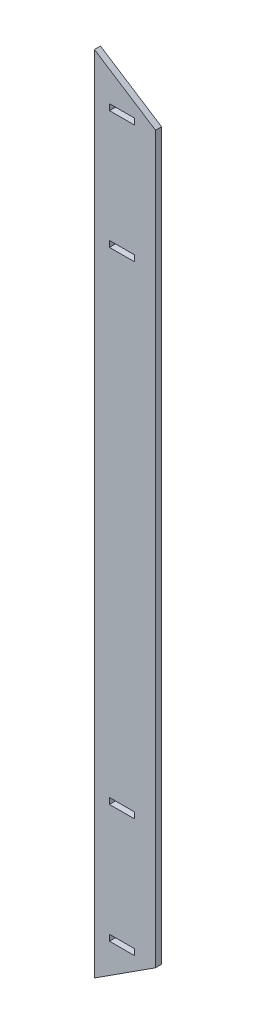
from build123d import *

# Parameters (mm, degrees)
SKETCH1_W           = 6.35
SKETCH1_H           = 1.524
BOSS_EXTRUDE1_DEPTH = 1.524


with BuildPart() as part:
    # Sketch1 → Boss-Extrude1 (new body)
    with BuildSketch(Plane.XY):
        Polygon((1.524, 9.955414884), (1.524, -193.244585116), (16.970138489, -183.289170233), (16.970138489, 0), align=None)
        with Locations((8.494834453, -0.762)):
            Rectangle(SKETCH1_W, SKETCH1_H, mode=Mode.SUBTRACT)
        with Locations((8.494834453, -30.690313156)):
            Rectangle(SKETCH1_W, SKETCH1_H, mode=Mode.SUBTRACT)
        with Locations((8.494834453, -152.598857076)):
            Rectangle(SKETCH1_W, SKETCH1_H, mode=Mode.SUBTRACT)
        with Locations((8.494834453, -182.527170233)):
            Rectangle(SKETCH1_W, SKETCH1_H, mode=Mode.SUBTRACT)
    extrude(amount=BOSS_EXTRUDE1_DEPTH)


solid = part.part
